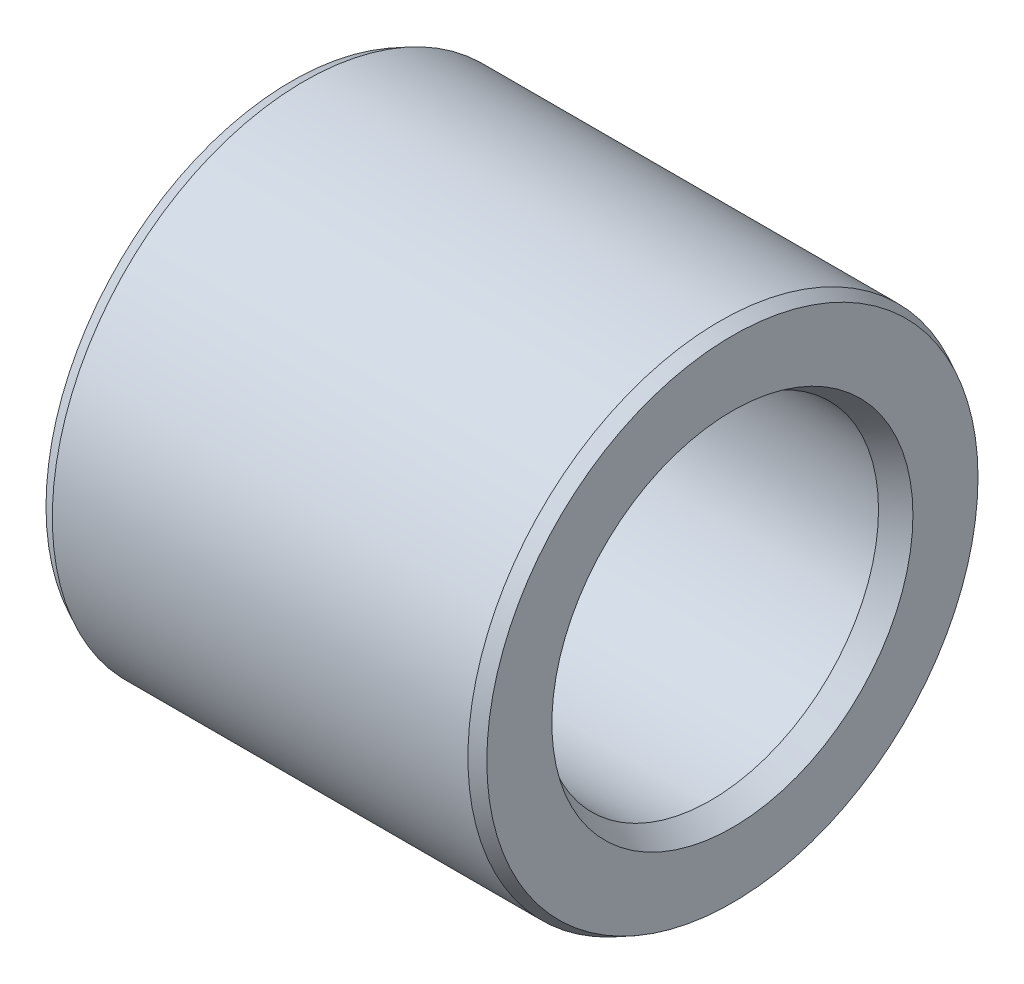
ISO-10303-21;
HEADER;
FILE_DESCRIPTION(('STEP AP214'),'2;1');
FILE_NAME('part.step','',(''),(''),'','','');
FILE_SCHEMA(('AUTOMOTIVE_DESIGN { 1 0 10303 214 1 1 1 1 }'));
ENDSEC;
DATA;
#1=APPLICATION_CONTEXT('core data for automotive mechanical design processes');
#2=APPLICATION_PROTOCOL_DEFINITION('international standard','automotive_design',2000,#1);
#3=PRODUCT_CONTEXT('',#1,'mechanical');
#4=PRODUCT('Part','Part','',(#3));
#5=PRODUCT_RELATED_PRODUCT_CATEGORY('part','',(#4));
#6=PRODUCT_DEFINITION_FORMATION('','',#4);
#7=PRODUCT_DEFINITION_CONTEXT('part definition',#1,'design');
#8=PRODUCT_DEFINITION('design','',#6,#7);
#9=PRODUCT_DEFINITION_SHAPE('','',#8);
#10=(LENGTH_UNIT() NAMED_UNIT(*) SI_UNIT(.MILLI.,.METRE.));
#11=(NAMED_UNIT(*) PLANE_ANGLE_UNIT() SI_UNIT($,.RADIAN.));
#12=(NAMED_UNIT(*) SI_UNIT($,.STERADIAN.) SOLID_ANGLE_UNIT());
#13=UNCERTAINTY_MEASURE_WITH_UNIT(LENGTH_MEASURE(1.E-05),#10,'distance_accuracy_value','');
#14=(GEOMETRIC_REPRESENTATION_CONTEXT(3) GLOBAL_UNCERTAINTY_ASSIGNED_CONTEXT((#13)) GLOBAL_UNIT_ASSIGNED_CONTEXT((#10,
#11,#12)) REPRESENTATION_CONTEXT('',''));
#15=CARTESIAN_POINT('',(0.,0.,0.));
#16=DIRECTION('',(0.,0.,1.));
#17=DIRECTION('',(1.,0.,0.));
#18=AXIS2_PLACEMENT_3D('',#15,#16,#17);
#19=CARTESIAN_POINT('',(0.3,0.,0.));
#20=DIRECTION('',(1.,0.,0.));
#21=DIRECTION('',(0.,0.,-1.));
#22=AXIS2_PLACEMENT_3D('',#19,#20,#21);
#23=CONICAL_SURFACE('',#22,6.,0.463647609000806);
#24=CARTESIAN_POINT('',(0.,0.,0.));
#25=DIRECTION('',(1.,0.,0.));
#26=DIRECTION('',(0.,0.,-1.));
#27=AXIS2_PLACEMENT_3D('',#24,#25,#26);
#28=CIRCLE('',#27,5.85);
#29=CARTESIAN_POINT('',(0.,0.,-5.85));
#30=VERTEX_POINT('',#29);
#31=EDGE_CURVE('E10',#30,#30,#28,.T.);
#32=ORIENTED_EDGE('',*,*,#31,.T.);
#33=EDGE_LOOP('',(#32));
#34=FACE_BOUND('',#33,.T.);
#35=CARTESIAN_POINT('',(0.3,0.,0.));
#36=DIRECTION('',(1.,0.,0.));
#37=DIRECTION('',(0.,0.,-1.));
#38=AXIS2_PLACEMENT_3D('',#35,#36,#37);
#39=CIRCLE('',#38,6.);
#40=CARTESIAN_POINT('',(0.3,0.,-6.));
#41=VERTEX_POINT('',#40);
#42=EDGE_CURVE('E61',#41,#41,#39,.T.);
#43=ORIENTED_EDGE('',*,*,#42,.F.);
#44=EDGE_LOOP('',(#43));
#45=FACE_BOUND('',#44,.T.);
#46=ADVANCED_FACE('F33',(#34,#45),#23,.T.);
#47=CARTESIAN_POINT('',(0.,5.85,0.));
#48=DIRECTION('',(-1.,0.,0.));
#49=DIRECTION('',(0.,0.,1.));
#50=AXIS2_PLACEMENT_3D('',#47,#48,#49);
#51=PLANE('',#50);
#52=CARTESIAN_POINT('',(0.,0.,0.));
#53=DIRECTION('',(1.,0.,0.));
#54=DIRECTION('',(0.,0.,-1.));
#55=AXIS2_PLACEMENT_3D('',#52,#53,#54);
#56=CIRCLE('',#55,4.3);
#57=CARTESIAN_POINT('',(0.,0.,-4.3));
#58=VERTEX_POINT('',#57);
#59=EDGE_CURVE('E39',#58,#58,#56,.T.);
#60=ORIENTED_EDGE('',*,*,#59,.T.);
#61=EDGE_LOOP('',(#60));
#62=FACE_BOUND('',#61,.T.);
#63=ORIENTED_EDGE('',*,*,#31,.F.);
#64=EDGE_LOOP('',(#63));
#65=FACE_BOUND('',#64,.T.);
#66=ADVANCED_FACE('F69',(#62,#65),#51,.T.);
#67=CARTESIAN_POINT('',(0.,0.,0.));
#68=DIRECTION('',(-1.,0.,0.));
#69=DIRECTION('',(0.,0.,1.));
#70=AXIS2_PLACEMENT_3D('',#67,#68,#69);
#71=CONICAL_SURFACE('',#70,4.3,0.523598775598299);
#72=CARTESIAN_POINT('',(0.519615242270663,0.,0.));
#73=DIRECTION('',(1.,0.,0.));
#74=DIRECTION('',(0.,0.,-1.));
#75=AXIS2_PLACEMENT_3D('',#72,#73,#74);
#76=CIRCLE('',#75,4.);
#77=CARTESIAN_POINT('',(0.519615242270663,0.,-4.));
#78=VERTEX_POINT('',#77);
#79=EDGE_CURVE('E43',#78,#78,#76,.T.);
#80=ORIENTED_EDGE('',*,*,#79,.T.);
#81=EDGE_LOOP('',(#80));
#82=FACE_BOUND('',#81,.T.);
#83=ORIENTED_EDGE('',*,*,#59,.F.);
#84=EDGE_LOOP('',(#83));
#85=FACE_BOUND('',#84,.T.);
#86=ADVANCED_FACE('F73',(#82,#85),#71,.F.);
#87=CARTESIAN_POINT('',(0.,0.,0.));
#88=DIRECTION('',(1.,0.,0.));
#89=DIRECTION('',(0.,0.,-1.));
#90=AXIS2_PLACEMENT_3D('',#87,#88,#89);
#91=CYLINDRICAL_SURFACE('',#90,4.);
#92=CARTESIAN_POINT('',(9.9803847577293,0.,0.));
#93=DIRECTION('',(1.,0.,0.));
#94=DIRECTION('',(0.,0.,-1.));
#95=AXIS2_PLACEMENT_3D('',#92,#93,#94);
#96=CIRCLE('',#95,4.);
#97=CARTESIAN_POINT('',(9.9803847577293,0.,-4.));
#98=VERTEX_POINT('',#97);
#99=EDGE_CURVE('E47',#98,#98,#96,.T.);
#100=ORIENTED_EDGE('',*,*,#99,.T.);
#101=EDGE_LOOP('',(#100));
#102=FACE_BOUND('',#101,.T.);
#103=ORIENTED_EDGE('',*,*,#79,.F.);
#104=EDGE_LOOP('',(#103));
#105=FACE_BOUND('',#104,.T.);
#106=ADVANCED_FACE('F77',(#102,#105),#91,.F.);
#107=CARTESIAN_POINT('',(9.9803847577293,0.,0.));
#108=DIRECTION('',(1.,0.,0.));
#109=DIRECTION('',(0.,0.,-1.));
#110=AXIS2_PLACEMENT_3D('',#107,#108,#109);
#111=CONICAL_SURFACE('',#110,4.,0.523598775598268);
#112=CARTESIAN_POINT('',(10.5,0.,0.));
#113=DIRECTION('',(1.,0.,0.));
#114=DIRECTION('',(0.,0.,-1.));
#115=AXIS2_PLACEMENT_3D('',#112,#113,#114);
#116=CIRCLE('',#115,4.3);
#117=CARTESIAN_POINT('',(10.5,0.,-4.3));
#118=VERTEX_POINT('',#117);
#119=EDGE_CURVE('E52',#118,#118,#116,.T.);
#120=ORIENTED_EDGE('',*,*,#119,.T.);
#121=EDGE_LOOP('',(#120));
#122=FACE_BOUND('',#121,.T.);
#123=ORIENTED_EDGE('',*,*,#99,.F.);
#124=EDGE_LOOP('',(#123));
#125=FACE_BOUND('',#124,.T.);
#126=ADVANCED_FACE('F84',(#122,#125),#111,.F.);
#127=CARTESIAN_POINT('',(10.5,4.3,0.));
#128=DIRECTION('',(1.,0.,0.));
#129=DIRECTION('',(0.,0.,-1.));
#130=AXIS2_PLACEMENT_3D('',#127,#128,#129);
#131=PLANE('',#130);
#132=CARTESIAN_POINT('',(10.5,0.,0.));
#133=DIRECTION('',(1.,0.,0.));
#134=DIRECTION('',(0.,0.,-1.));
#135=AXIS2_PLACEMENT_3D('',#132,#133,#134);
#136=CIRCLE('',#135,5.85);
#137=CARTESIAN_POINT('',(10.5,0.,-5.85));
#138=VERTEX_POINT('',#137);
#139=EDGE_CURVE('E55',#138,#138,#136,.T.);
#140=ORIENTED_EDGE('',*,*,#139,.T.);
#141=EDGE_LOOP('',(#140));
#142=FACE_BOUND('',#141,.T.);
#143=ORIENTED_EDGE('',*,*,#119,.F.);
#144=EDGE_LOOP('',(#143));
#145=FACE_BOUND('',#144,.T.);
#146=ADVANCED_FACE('F88',(#142,#145),#131,.T.);
#147=CARTESIAN_POINT('',(10.5,0.,0.));
#148=DIRECTION('',(-1.,0.,0.));
#149=DIRECTION('',(0.,0.,1.));
#150=AXIS2_PLACEMENT_3D('',#147,#148,#149);
#151=CONICAL_SURFACE('',#150,5.85,0.463647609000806);
#152=CARTESIAN_POINT('',(10.2,0.,0.));
#153=DIRECTION('',(1.,0.,0.));
#154=DIRECTION('',(0.,0.,-1.));
#155=AXIS2_PLACEMENT_3D('',#152,#153,#154);
#156=CIRCLE('',#155,6.);
#157=CARTESIAN_POINT('',(10.2,0.,-6.));
#158=VERTEX_POINT('',#157);
#159=EDGE_CURVE('E58',#158,#158,#156,.T.);
#160=ORIENTED_EDGE('',*,*,#159,.T.);
#161=EDGE_LOOP('',(#160));
#162=FACE_BOUND('',#161,.T.);
#163=ORIENTED_EDGE('',*,*,#139,.F.);
#164=EDGE_LOOP('',(#163));
#165=FACE_BOUND('',#164,.T.);
#166=ADVANCED_FACE('F92',(#162,#165),#151,.T.);
#167=CARTESIAN_POINT('',(0.,0.,0.));
#168=DIRECTION('',(1.,0.,0.));
#169=DIRECTION('',(0.,0.,-1.));
#170=AXIS2_PLACEMENT_3D('',#167,#168,#169);
#171=CYLINDRICAL_SURFACE('',#170,6.);
#172=ORIENTED_EDGE('',*,*,#42,.T.);
#173=EDGE_LOOP('',(#172));
#174=FACE_BOUND('',#173,.T.);
#175=ORIENTED_EDGE('',*,*,#159,.F.);
#176=EDGE_LOOP('',(#175));
#177=FACE_BOUND('',#176,.T.);
#178=ADVANCED_FACE('F65',(#174,#177),#171,.T.);
#179=CLOSED_SHELL('',(#46,#66,#86,#106,#126,#146,#166,#178));
#180=MANIFOLD_SOLID_BREP('B2',#179);
#181=ADVANCED_BREP_SHAPE_REPRESENTATION('',(#18,#180),#14);
#182=SHAPE_DEFINITION_REPRESENTATION(#9,#181);
ENDSEC;
END-ISO-10303-21;
